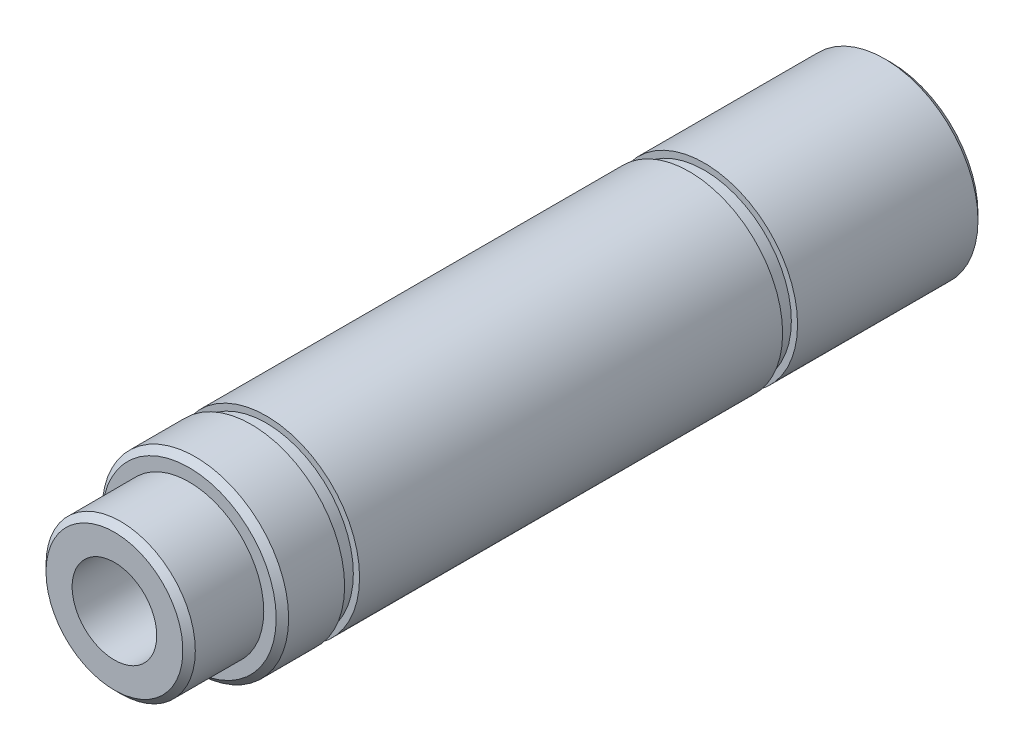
ISO-10303-21;
HEADER;
FILE_DESCRIPTION(('STEP AP214'),'2;1');
FILE_NAME('part.step','',(''),(''),'','','');
FILE_SCHEMA(('AUTOMOTIVE_DESIGN { 1 0 10303 214 1 1 1 1 }'));
ENDSEC;
DATA;
#1=APPLICATION_CONTEXT('core data for automotive mechanical design processes');
#2=APPLICATION_PROTOCOL_DEFINITION('international standard','automotive_design',2000,#1);
#3=PRODUCT_CONTEXT('',#1,'mechanical');
#4=PRODUCT('Part','Part','',(#3));
#5=PRODUCT_RELATED_PRODUCT_CATEGORY('part','',(#4));
#6=PRODUCT_DEFINITION_FORMATION('','',#4);
#7=PRODUCT_DEFINITION_CONTEXT('part definition',#1,'design');
#8=PRODUCT_DEFINITION('design','',#6,#7);
#9=PRODUCT_DEFINITION_SHAPE('','',#8);
#10=(LENGTH_UNIT() NAMED_UNIT(*) SI_UNIT(.MILLI.,.METRE.));
#11=(NAMED_UNIT(*) PLANE_ANGLE_UNIT() SI_UNIT($,.RADIAN.));
#12=(NAMED_UNIT(*) SI_UNIT($,.STERADIAN.) SOLID_ANGLE_UNIT());
#13=UNCERTAINTY_MEASURE_WITH_UNIT(LENGTH_MEASURE(1.E-05),#10,'distance_accuracy_value','');
#14=(GEOMETRIC_REPRESENTATION_CONTEXT(3) GLOBAL_UNCERTAINTY_ASSIGNED_CONTEXT((#13)) GLOBAL_UNIT_ASSIGNED_CONTEXT((#10,
#11,#12)) REPRESENTATION_CONTEXT('',''));
#15=CARTESIAN_POINT('',(0.,0.,0.));
#16=DIRECTION('',(0.,0.,1.));
#17=DIRECTION('',(1.,0.,0.));
#18=AXIS2_PLACEMENT_3D('',#15,#16,#17);
#19=CARTESIAN_POINT('',(0.,6.,31.2));
#20=DIRECTION('',(0.,0.,-1.));
#21=DIRECTION('',(-1.,0.,0.));
#22=AXIS2_PLACEMENT_3D('',#19,#20,#21);
#23=PLANE('',#22);
#24=CARTESIAN_POINT('',(0.,0.,31.2));
#25=DIRECTION('',(0.,0.,-1.));
#26=DIRECTION('',(-1.,0.,0.));
#27=AXIS2_PLACEMENT_3D('',#24,#25,#26);
#28=CIRCLE('',#27,5.5);
#29=CARTESIAN_POINT('',(-5.5,0.,31.2));
#30=VERTEX_POINT('',#29);
#31=EDGE_CURVE('E46',#30,#30,#28,.F.);
#32=ORIENTED_EDGE('',*,*,#31,.T.);
#33=EDGE_LOOP('',(#32));
#34=FACE_BOUND('',#33,.T.);
#35=CARTESIAN_POINT('',(0.,0.,31.2));
#36=DIRECTION('',(0.,0.,1.));
#37=DIRECTION('',(1.,0.,0.));
#38=AXIS2_PLACEMENT_3D('',#35,#36,#37);
#39=CIRCLE('',#38,3.4);
#40=CARTESIAN_POINT('',(3.4,0.,31.2));
#41=VERTEX_POINT('',#40);
#42=EDGE_CURVE('E60',#41,#41,#39,.T.);
#43=ORIENTED_EDGE('',*,*,#42,.F.);
#44=EDGE_LOOP('',(#43));
#45=FACE_BOUND('',#44,.T.);
#46=ADVANCED_FACE('F38',(#34,#45),#23,.F.);
#47=CARTESIAN_POINT('',(0.,0.,47.7127659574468));
#48=DIRECTION('',(0.,0.,1.));
#49=DIRECTION('',(1.,0.,0.));
#50=AXIS2_PLACEMENT_3D('',#47,#48,#49);
#51=CYLINDRICAL_SURFACE('',#50,6.);
#52=CARTESIAN_POINT('',(0.,0.,30.7));
#53=DIRECTION('',(0.,0.,-1.));
#54=DIRECTION('',(-1.,0.,0.));
#55=AXIS2_PLACEMENT_3D('',#52,#53,#54);
#56=CIRCLE('',#55,6.);
#57=CARTESIAN_POINT('',(-6.,0.,30.7));
#58=VERTEX_POINT('',#57);
#59=EDGE_CURVE('E11',#58,#58,#56,.T.);
#60=ORIENTED_EDGE('',*,*,#59,.T.);
#61=EDGE_LOOP('',(#60));
#62=FACE_BOUND('',#61,.T.);
#63=CARTESIAN_POINT('',(0.,0.,25.2));
#64=DIRECTION('',(0.,0.,1.));
#65=DIRECTION('',(1.,0.,0.));
#66=AXIS2_PLACEMENT_3D('',#63,#64,#65);
#67=CIRCLE('',#66,6.);
#68=CARTESIAN_POINT('',(6.,0.,25.2));
#69=VERTEX_POINT('',#68);
#70=EDGE_CURVE('E88',#69,#69,#67,.T.);
#71=ORIENTED_EDGE('',*,*,#70,.T.);
#72=EDGE_LOOP('',(#71));
#73=FACE_BOUND('',#72,.T.);
#74=ADVANCED_FACE('F117',(#62,#73),#51,.T.);
#75=CARTESIAN_POINT('',(0.,7.5,25.2));
#76=DIRECTION('',(0.,0.,-1.));
#77=DIRECTION('',(-1.,0.,0.));
#78=AXIS2_PLACEMENT_3D('',#75,#76,#77);
#79=PLANE('',#78);
#80=CARTESIAN_POINT('',(0.,0.,25.2));
#81=DIRECTION('',(0.,0.,-1.));
#82=DIRECTION('',(-1.,0.,0.));
#83=AXIS2_PLACEMENT_3D('',#80,#81,#82);
#84=CIRCLE('',#83,7.00000000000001);
#85=CARTESIAN_POINT('',(-7.00000000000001,0.,25.2));
#86=VERTEX_POINT('',#85);
#87=EDGE_CURVE('E97',#86,#86,#84,.F.);
#88=ORIENTED_EDGE('',*,*,#87,.T.);
#89=EDGE_LOOP('',(#88));
#90=FACE_BOUND('',#89,.T.);
#91=ORIENTED_EDGE('',*,*,#70,.F.);
#92=EDGE_LOOP('',(#91));
#93=FACE_BOUND('',#92,.T.);
#94=ADVANCED_FACE('F122',(#90,#93),#79,.F.);
#95=CARTESIAN_POINT('',(0.,0.,47.7127659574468));
#96=DIRECTION('',(0.,0.,1.));
#97=DIRECTION('',(1.,0.,0.));
#98=AXIS2_PLACEMENT_3D('',#95,#96,#97);
#99=CYLINDRICAL_SURFACE('',#98,7.5);
#100=CARTESIAN_POINT('',(0.,0.,24.7));
#101=DIRECTION('',(0.,0.,-1.));
#102=DIRECTION('',(-1.,0.,0.));
#103=AXIS2_PLACEMENT_3D('',#100,#101,#102);
#104=CIRCLE('',#103,7.5);
#105=CARTESIAN_POINT('',(-7.5,0.,24.7));
#106=VERTEX_POINT('',#105);
#107=EDGE_CURVE('E100',#106,#106,#104,.T.);
#108=ORIENTED_EDGE('',*,*,#107,.T.);
#109=EDGE_LOOP('',(#108));
#110=FACE_BOUND('',#109,.T.);
#111=CARTESIAN_POINT('',(0.,0.,20.2));
#112=DIRECTION('',(0.,0.,1.));
#113=DIRECTION('',(1.,0.,0.));
#114=AXIS2_PLACEMENT_3D('',#111,#112,#113);
#115=CIRCLE('',#114,7.5);
#116=CARTESIAN_POINT('',(7.5,0.,20.2));
#117=VERTEX_POINT('',#116);
#118=EDGE_CURVE('E85',#117,#117,#115,.T.);
#119=ORIENTED_EDGE('',*,*,#118,.T.);
#120=EDGE_LOOP('',(#119));
#121=FACE_BOUND('',#120,.T.);
#122=ADVANCED_FACE('F183',(#110,#121),#99,.T.);
#123=CARTESIAN_POINT('',(0.,7.5,20.2));
#124=DIRECTION('',(0.,0.,1.));
#125=DIRECTION('',(1.,0.,0.));
#126=AXIS2_PLACEMENT_3D('',#123,#124,#125);
#127=PLANE('',#126);
#128=ORIENTED_EDGE('',*,*,#118,.F.);
#129=EDGE_LOOP('',(#128));
#130=FACE_BOUND('',#129,.T.);
#131=CARTESIAN_POINT('',(0.,0.,20.2));
#132=DIRECTION('',(0.,0.,1.));
#133=DIRECTION('',(1.,0.,0.));
#134=AXIS2_PLACEMENT_3D('',#131,#132,#133);
#135=CIRCLE('',#134,7.);
#136=CARTESIAN_POINT('',(7.,0.,20.2));
#137=VERTEX_POINT('',#136);
#138=EDGE_CURVE('E82',#137,#137,#135,.T.);
#139=ORIENTED_EDGE('',*,*,#138,.T.);
#140=EDGE_LOOP('',(#139));
#141=FACE_BOUND('',#140,.T.);
#142=ADVANCED_FACE('F179',(#130,#141),#127,.F.);
#143=CARTESIAN_POINT('',(0.,0.,47.7127659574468));
#144=DIRECTION('',(0.,0.,1.));
#145=DIRECTION('',(1.,0.,0.));
#146=AXIS2_PLACEMENT_3D('',#143,#144,#145);
#147=CYLINDRICAL_SURFACE('',#146,7.);
#148=ORIENTED_EDGE('',*,*,#138,.F.);
#149=EDGE_LOOP('',(#148));
#150=FACE_BOUND('',#149,.T.);
#151=CARTESIAN_POINT('',(0.,0.,19.));
#152=DIRECTION('',(0.,0.,1.));
#153=DIRECTION('',(1.,0.,0.));
#154=AXIS2_PLACEMENT_3D('',#151,#152,#153);
#155=CIRCLE('',#154,7.);
#156=CARTESIAN_POINT('',(7.,0.,19.));
#157=VERTEX_POINT('',#156);
#158=EDGE_CURVE('E79',#157,#157,#155,.T.);
#159=ORIENTED_EDGE('',*,*,#158,.T.);
#160=EDGE_LOOP('',(#159));
#161=FACE_BOUND('',#160,.T.);
#162=ADVANCED_FACE('F175',(#150,#161),#147,.T.);
#163=CARTESIAN_POINT('',(0.,7.,19.));
#164=DIRECTION('',(0.,0.,-1.));
#165=DIRECTION('',(-1.,0.,0.));
#166=AXIS2_PLACEMENT_3D('',#163,#164,#165);
#167=PLANE('',#166);
#168=ORIENTED_EDGE('',*,*,#158,.F.);
#169=EDGE_LOOP('',(#168));
#170=FACE_BOUND('',#169,.T.);
#171=CARTESIAN_POINT('',(0.,0.,19.));
#172=DIRECTION('',(0.,0.,1.));
#173=DIRECTION('',(1.,0.,0.));
#174=AXIS2_PLACEMENT_3D('',#171,#172,#173);
#175=CIRCLE('',#174,7.5);
#176=CARTESIAN_POINT('',(7.5,0.,19.));
#177=VERTEX_POINT('',#176);
#178=EDGE_CURVE('E76',#177,#177,#175,.T.);
#179=ORIENTED_EDGE('',*,*,#178,.T.);
#180=EDGE_LOOP('',(#179));
#181=FACE_BOUND('',#180,.T.);
#182=ADVANCED_FACE('F171',(#170,#181),#167,.F.);
#183=CARTESIAN_POINT('',(0.,0.,47.7127659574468));
#184=DIRECTION('',(0.,0.,1.));
#185=DIRECTION('',(1.,0.,0.));
#186=AXIS2_PLACEMENT_3D('',#183,#184,#185);
#187=CYLINDRICAL_SURFACE('',#186,7.5);
#188=ORIENTED_EDGE('',*,*,#178,.F.);
#189=EDGE_LOOP('',(#188));
#190=FACE_BOUND('',#189,.T.);
#191=CARTESIAN_POINT('',(0.,0.,-15.));
#192=DIRECTION('',(0.,0.,1.));
#193=DIRECTION('',(1.,0.,0.));
#194=AXIS2_PLACEMENT_3D('',#191,#192,#193);
#195=CIRCLE('',#194,7.5);
#196=CARTESIAN_POINT('',(7.5,0.,-15.));
#197=VERTEX_POINT('',#196);
#198=EDGE_CURVE('E73',#197,#197,#195,.T.);
#199=ORIENTED_EDGE('',*,*,#198,.T.);
#200=EDGE_LOOP('',(#199));
#201=FACE_BOUND('',#200,.T.);
#202=ADVANCED_FACE('F167',(#190,#201),#187,.T.);
#203=CARTESIAN_POINT('',(0.,7.5,-15.));
#204=DIRECTION('',(0.,0.,1.));
#205=DIRECTION('',(1.,0.,0.));
#206=AXIS2_PLACEMENT_3D('',#203,#204,#205);
#207=PLANE('',#206);
#208=ORIENTED_EDGE('',*,*,#198,.F.);
#209=EDGE_LOOP('',(#208));
#210=FACE_BOUND('',#209,.T.);
#211=CARTESIAN_POINT('',(0.,0.,-15.));
#212=DIRECTION('',(0.,0.,1.));
#213=DIRECTION('',(1.,0.,0.));
#214=AXIS2_PLACEMENT_3D('',#211,#212,#213);
#215=CIRCLE('',#214,7.);
#216=CARTESIAN_POINT('',(7.,0.,-15.));
#217=VERTEX_POINT('',#216);
#218=EDGE_CURVE('E70',#217,#217,#215,.T.);
#219=ORIENTED_EDGE('',*,*,#218,.T.);
#220=EDGE_LOOP('',(#219));
#221=FACE_BOUND('',#220,.T.);
#222=ADVANCED_FACE('F159',(#210,#221),#207,.F.);
#223=CARTESIAN_POINT('',(0.,0.,47.7127659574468));
#224=DIRECTION('',(0.,0.,1.));
#225=DIRECTION('',(1.,0.,0.));
#226=AXIS2_PLACEMENT_3D('',#223,#224,#225);
#227=CYLINDRICAL_SURFACE('',#226,7.);
#228=ORIENTED_EDGE('',*,*,#218,.F.);
#229=EDGE_LOOP('',(#228));
#230=FACE_BOUND('',#229,.T.);
#231=CARTESIAN_POINT('',(0.,0.,-16.2));
#232=DIRECTION('',(0.,0.,1.));
#233=DIRECTION('',(1.,0.,0.));
#234=AXIS2_PLACEMENT_3D('',#231,#232,#233);
#235=CIRCLE('',#234,7.);
#236=CARTESIAN_POINT('',(7.,0.,-16.2));
#237=VERTEX_POINT('',#236);
#238=EDGE_CURVE('E63',#237,#237,#235,.T.);
#239=ORIENTED_EDGE('',*,*,#238,.T.);
#240=EDGE_LOOP('',(#239));
#241=FACE_BOUND('',#240,.T.);
#242=ADVANCED_FACE('F153',(#230,#241),#227,.T.);
#243=CARTESIAN_POINT('',(0.,7.,-16.2));
#244=DIRECTION('',(0.,0.,-1.));
#245=DIRECTION('',(-1.,0.,0.));
#246=AXIS2_PLACEMENT_3D('',#243,#244,#245);
#247=PLANE('',#246);
#248=ORIENTED_EDGE('',*,*,#238,.F.);
#249=EDGE_LOOP('',(#248));
#250=FACE_BOUND('',#249,.T.);
#251=CARTESIAN_POINT('',(0.,0.,-16.2));
#252=DIRECTION('',(0.,0.,1.));
#253=DIRECTION('',(1.,0.,0.));
#254=AXIS2_PLACEMENT_3D('',#251,#252,#253);
#255=CIRCLE('',#254,7.5);
#256=CARTESIAN_POINT('',(7.5,0.,-16.2));
#257=VERTEX_POINT('',#256);
#258=EDGE_CURVE('E59',#257,#257,#255,.T.);
#259=ORIENTED_EDGE('',*,*,#258,.T.);
#260=EDGE_LOOP('',(#259));
#261=FACE_BOUND('',#260,.T.);
#262=ADVANCED_FACE('F148',(#250,#261),#247,.F.);
#263=CARTESIAN_POINT('',(0.,0.,47.7127659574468));
#264=DIRECTION('',(0.,0.,1.));
#265=DIRECTION('',(1.,0.,0.));
#266=AXIS2_PLACEMENT_3D('',#263,#264,#265);
#267=CYLINDRICAL_SURFACE('',#266,7.5);
#268=CARTESIAN_POINT('',(0.,0.,-30.7));
#269=DIRECTION('',(0.,0.,1.));
#270=DIRECTION('',(1.,0.,0.));
#271=AXIS2_PLACEMENT_3D('',#268,#269,#270);
#272=CIRCLE('',#271,7.5);
#273=CARTESIAN_POINT('',(7.5,0.,-30.7));
#274=VERTEX_POINT('',#273);
#275=EDGE_CURVE('E91',#274,#274,#272,.T.);
#276=ORIENTED_EDGE('',*,*,#275,.T.);
#277=EDGE_LOOP('',(#276));
#278=FACE_BOUND('',#277,.T.);
#279=ORIENTED_EDGE('',*,*,#258,.F.);
#280=EDGE_LOOP('',(#279));
#281=FACE_BOUND('',#280,.T.);
#282=ADVANCED_FACE('F145',(#278,#281),#267,.T.);
#283=CARTESIAN_POINT('',(0.,7.5,-31.2));
#284=DIRECTION('',(0.,0.,1.));
#285=DIRECTION('',(1.,0.,0.));
#286=AXIS2_PLACEMENT_3D('',#283,#284,#285);
#287=PLANE('',#286);
#288=CARTESIAN_POINT('',(0.,0.,-31.2));
#289=DIRECTION('',(0.,0.,1.));
#290=DIRECTION('',(1.,0.,0.));
#291=AXIS2_PLACEMENT_3D('',#288,#289,#290);
#292=CIRCLE('',#291,7.);
#293=CARTESIAN_POINT('',(7.,0.,-31.2));
#294=VERTEX_POINT('',#293);
#295=EDGE_CURVE('E94',#294,#294,#292,.F.);
#296=ORIENTED_EDGE('',*,*,#295,.T.);
#297=EDGE_LOOP('',(#296));
#298=FACE_BOUND('',#297,.T.);
#299=ADVANCED_FACE('F53',(#298),#287,.F.);
#300=CARTESIAN_POINT('',(0.,0.,1.2));
#301=DIRECTION('',(0.,0.,1.));
#302=DIRECTION('',(1.,0.,0.));
#303=AXIS2_PLACEMENT_3D('',#300,#301,#302);
#304=CONICAL_SURFACE('',#303,3.39999999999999,1.02974425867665);
#305=CARTESIAN_POINT('',(0.,0.,-0.842926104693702));
#306=VERTEX_POINT('',#305);
#307=VERTEX_LOOP('',#306);
#308=FACE_BOUND('',#307,.T.);
#309=CARTESIAN_POINT('',(0.,0.,1.2));
#310=DIRECTION('',(0.,0.,1.));
#311=DIRECTION('',(1.,0.,0.));
#312=AXIS2_PLACEMENT_3D('',#309,#310,#311);
#313=CIRCLE('',#312,3.39999999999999);
#314=CARTESIAN_POINT('',(3.39999999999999,0.,1.2));
#315=VERTEX_POINT('',#314);
#316=EDGE_CURVE('E57',#315,#315,#313,.T.);
#317=ORIENTED_EDGE('',*,*,#316,.T.);
#318=EDGE_LOOP('',(#317));
#319=FACE_BOUND('',#318,.T.);
#320=ADVANCED_FACE('F49',(#308,#319),#304,.F.);
#321=CARTESIAN_POINT('',(0.,0.,31.2));
#322=DIRECTION('',(0.,0.,1.));
#323=DIRECTION('',(1.,0.,0.));
#324=AXIS2_PLACEMENT_3D('',#321,#322,#323);
#325=CYLINDRICAL_SURFACE('',#324,3.4);
#326=ORIENTED_EDGE('',*,*,#316,.F.);
#327=EDGE_LOOP('',(#326));
#328=FACE_BOUND('',#327,.T.);
#329=ORIENTED_EDGE('',*,*,#42,.T.);
#330=EDGE_LOOP('',(#329));
#331=FACE_BOUND('',#330,.T.);
#332=ADVANCED_FACE('F52',(#328,#331),#325,.F.);
#333=CARTESIAN_POINT('',(0.,0.,-30.7));
#334=DIRECTION('',(0.,0.,1.));
#335=DIRECTION('',(1.,0.,0.));
#336=AXIS2_PLACEMENT_3D('',#333,#334,#335);
#337=CONICAL_SURFACE('',#336,7.5,0.785398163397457);
#338=ORIENTED_EDGE('',*,*,#295,.F.);
#339=EDGE_LOOP('',(#338));
#340=FACE_BOUND('',#339,.T.);
#341=ORIENTED_EDGE('',*,*,#275,.F.);
#342=EDGE_LOOP('',(#341));
#343=FACE_BOUND('',#342,.T.);
#344=ADVANCED_FACE('F113',(#340,#343),#337,.T.);
#345=CARTESIAN_POINT('',(0.,0.,25.2));
#346=DIRECTION('',(0.,0.,-1.));
#347=DIRECTION('',(-1.,0.,0.));
#348=AXIS2_PLACEMENT_3D('',#345,#346,#347);
#349=CONICAL_SURFACE('',#348,7.00000000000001,0.785398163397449);
#350=ORIENTED_EDGE('',*,*,#107,.F.);
#351=EDGE_LOOP('',(#350));
#352=FACE_BOUND('',#351,.T.);
#353=ORIENTED_EDGE('',*,*,#87,.F.);
#354=EDGE_LOOP('',(#353));
#355=FACE_BOUND('',#354,.T.);
#356=ADVANCED_FACE('F108',(#352,#355),#349,.T.);
#357=CARTESIAN_POINT('',(0.,0.,31.2));
#358=DIRECTION('',(0.,0.,-1.));
#359=DIRECTION('',(-1.,0.,0.));
#360=AXIS2_PLACEMENT_3D('',#357,#358,#359);
#361=CONICAL_SURFACE('',#360,5.5,0.785398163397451);
#362=ORIENTED_EDGE('',*,*,#59,.F.);
#363=EDGE_LOOP('',(#362));
#364=FACE_BOUND('',#363,.T.);
#365=ORIENTED_EDGE('',*,*,#31,.F.);
#366=EDGE_LOOP('',(#365));
#367=FACE_BOUND('',#366,.T.);
#368=ADVANCED_FACE('F41',(#364,#367),#361,.T.);
#369=CLOSED_SHELL('',(#46,#74,#94,#122,#142,#162,#182,#202,#222,#242,#262,#282,#299,#320,#332,
#344,#356,#368));
#370=MANIFOLD_SOLID_BREP('B2',#369);
#371=ADVANCED_BREP_SHAPE_REPRESENTATION('',(#18,#370),#14);
#372=SHAPE_DEFINITION_REPRESENTATION(#9,#371);
ENDSEC;
END-ISO-10303-21;
